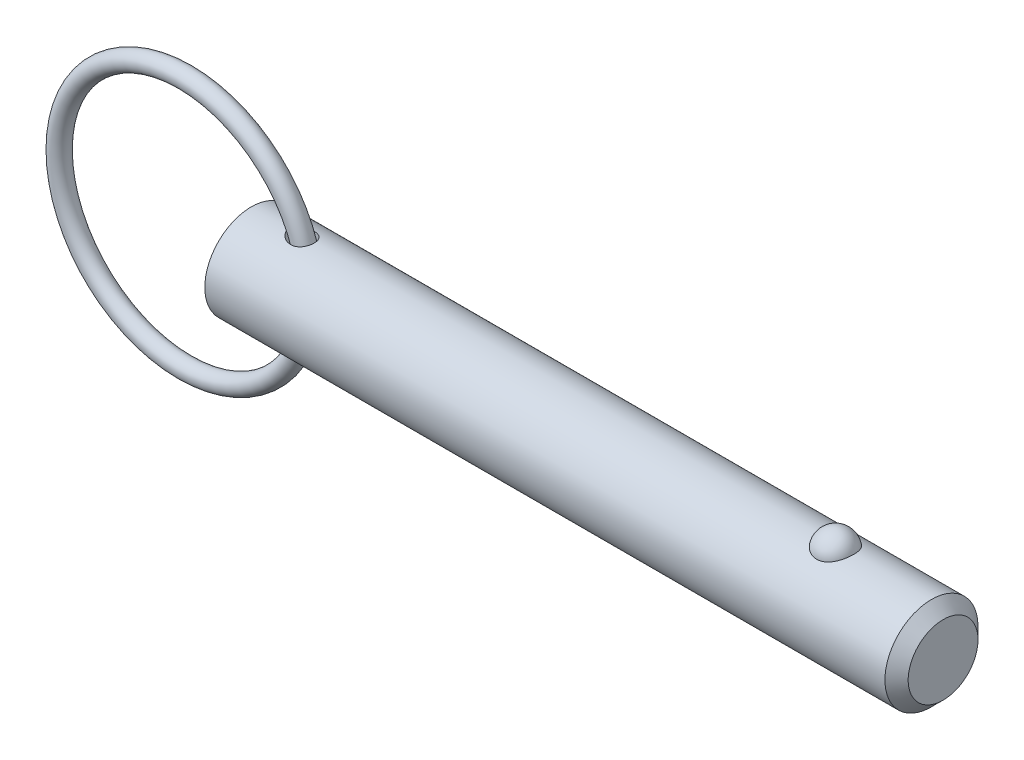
ISO-10303-21;
HEADER;
FILE_DESCRIPTION(('STEP AP214'),'2;1');
FILE_NAME('part.step','',(''),(''),'','','');
FILE_SCHEMA(('AUTOMOTIVE_DESIGN { 1 0 10303 214 1 1 1 1 }'));
ENDSEC;
DATA;
#1=APPLICATION_CONTEXT('core data for automotive mechanical design processes');
#2=APPLICATION_PROTOCOL_DEFINITION('international standard','automotive_design',2000,#1);
#3=PRODUCT_CONTEXT('',#1,'mechanical');
#4=PRODUCT('Part','Part','',(#3));
#5=PRODUCT_RELATED_PRODUCT_CATEGORY('part','',(#4));
#6=PRODUCT_DEFINITION_FORMATION('','',#4);
#7=PRODUCT_DEFINITION_CONTEXT('part definition',#1,'design');
#8=PRODUCT_DEFINITION('design','',#6,#7);
#9=PRODUCT_DEFINITION_SHAPE('','',#8);
#10=(LENGTH_UNIT() NAMED_UNIT(*) SI_UNIT(.MILLI.,.METRE.));
#11=(NAMED_UNIT(*) PLANE_ANGLE_UNIT() SI_UNIT($,.RADIAN.));
#12=(NAMED_UNIT(*) SI_UNIT($,.STERADIAN.) SOLID_ANGLE_UNIT());
#13=UNCERTAINTY_MEASURE_WITH_UNIT(LENGTH_MEASURE(1.E-05),#10,'distance_accuracy_value','');
#14=(GEOMETRIC_REPRESENTATION_CONTEXT(3) GLOBAL_UNCERTAINTY_ASSIGNED_CONTEXT((#13)) GLOBAL_UNIT_ASSIGNED_CONTEXT((#10,
#11,#12)) REPRESENTATION_CONTEXT('',''));
#15=CARTESIAN_POINT('',(0.,0.,0.));
#16=DIRECTION('',(0.,0.,1.));
#17=DIRECTION('',(1.,0.,0.));
#18=AXIS2_PLACEMENT_3D('',#15,#16,#17);
#19=CARTESIAN_POINT('',(-6.70471658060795,0.,0.));
#20=DIRECTION('',(0.,0.,1.));
#21=DIRECTION('',(1.,0.,0.));
#22=AXIS2_PLACEMENT_3D('',#19,#20,#21);
#23=TOROIDAL_SURFACE('',#22,12.7,0.940000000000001);
#24=CARTESIAN_POINT('',(6.93528341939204,0.,0.));
#25=VERTEX_POINT('',#24);
#26=VERTEX_LOOP('',#25);
#27=FACE_BOUND('',#26,.T.);
#28=ADVANCED_FACE('P0_F12',(#27),#23,.T.);
#29=CLOSED_SHELL('',(#28));
#30=MANIFOLD_SOLID_BREP('P0_B1',#29);
#31=CARTESIAN_POINT('',(0.,0.,0.));
#32=DIRECTION('',(1.,0.,0.));
#33=DIRECTION('',(0.,0.,-1.));
#34=AXIS2_PLACEMENT_3D('',#31,#32,#33);
#35=CYLINDRICAL_SURFACE('',#34,4.7);
#36=CARTESIAN_POINT('',(4.16378072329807,4.63584137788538,-0.773934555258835));
#37=CARTESIAN_POINT('',(4.22041228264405,4.62659903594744,-0.829297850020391));
#38=CARTESIAN_POINT('',(4.28206987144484,4.61719767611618,-0.879522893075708));
#39=CARTESIAN_POINT('',(4.4130315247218,4.59925351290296,-0.968997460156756));
#40=CARTESIAN_POINT('',(4.48234424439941,4.59071170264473,-1.00823437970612));
#41=CARTESIAN_POINT('',(4.62650734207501,4.5755493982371,-1.07495006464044));
#42=CARTESIAN_POINT('',(4.70135029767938,4.56892638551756,-1.10244426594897));
#43=CARTESIAN_POINT('',(4.85470490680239,4.55848940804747,-1.14483874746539));
#44=CARTESIAN_POINT('',(4.93321503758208,4.55467428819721,-1.15974420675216));
#45=CARTESIAN_POINT('',(5.09197970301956,4.55051176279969,-1.17597559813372));
#46=CARTESIAN_POINT('',(5.17223836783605,4.55017372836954,-1.17726483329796));
#47=CARTESIAN_POINT('',(5.33159446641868,4.55326696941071,-1.16524823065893));
#48=CARTESIAN_POINT('',(5.41069268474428,4.55669556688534,-1.15195276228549));
#49=CARTESIAN_POINT('',(5.55698758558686,4.56647801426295,-1.11249214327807));
#50=CARTESIAN_POINT('',(5.62458628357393,4.57250771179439,-1.08773548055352));
#51=CARTESIAN_POINT('',(5.75397700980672,4.58665356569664,-1.02644632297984));
#52=CARTESIAN_POINT('',(5.81577171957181,4.59476875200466,-0.989919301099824));
#53=CARTESIAN_POINT('',(5.92681484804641,4.61135052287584,-0.909391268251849));
#54=CARTESIAN_POINT('',(5.9766679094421,4.61973919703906,-0.866204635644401));
#55=CARTESIAN_POINT('',(6.0681785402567,4.63643253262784,-0.771868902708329));
#56=CARTESIAN_POINT('',(6.10983710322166,4.64473720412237,-0.72072076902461));
#57=CARTESIAN_POINT('',(6.18318089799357,4.660174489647,-0.612928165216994));
#58=CARTESIAN_POINT('',(6.21503150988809,4.66732544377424,-0.556398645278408));
#59=CARTESIAN_POINT('',(6.26900210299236,4.67985590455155,-0.438689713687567));
#60=CARTESIAN_POINT('',(6.29112194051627,4.68523538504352,-0.377510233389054));
#61=CARTESIAN_POINT('',(6.32523846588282,4.6936733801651,-0.251831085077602));
#62=CARTESIAN_POINT('',(6.33717189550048,4.69671737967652,-0.187313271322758));
#63=CARTESIAN_POINT('',(6.35042407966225,4.70010386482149,-0.0571258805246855));
#64=CARTESIAN_POINT('',(6.35174249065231,4.70044626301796,0.0085437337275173));
#65=CARTESIAN_POINT('',(6.34371729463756,4.69838816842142,0.139481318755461));
#66=CARTESIAN_POINT('',(6.33432596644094,4.69597539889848,0.204746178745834));
#67=CARTESIAN_POINT('',(6.30500866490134,4.68864655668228,0.332720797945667));
#68=CARTESIAN_POINT('',(6.28508259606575,4.68373046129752,0.395430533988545));
#69=CARTESIAN_POINT('',(6.23516511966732,4.67193431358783,0.516455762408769));
#70=CARTESIAN_POINT('',(6.20518126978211,4.66505573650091,0.574774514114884));
#71=CARTESIAN_POINT('',(6.13586314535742,4.65009270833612,0.685387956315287));
#72=CARTESIAN_POINT('',(6.09652950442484,4.64200833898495,0.737683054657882));
#73=CARTESIAN_POINT('',(6.00979078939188,4.62559001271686,0.834455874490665));
#74=CARTESIAN_POINT('',(5.96243625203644,4.61725787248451,0.878979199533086));
#75=CARTESIAN_POINT('',(5.86079843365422,4.60122574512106,0.959378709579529));
#76=CARTESIAN_POINT('',(5.80651591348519,4.59352568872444,0.9952558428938));
#77=CARTESIAN_POINT('',(5.69277386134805,4.57961669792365,1.05741527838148));
#78=CARTESIAN_POINT('',(5.63333134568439,4.57340309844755,1.08372773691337));
#79=CARTESIAN_POINT('',(5.51084249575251,4.56305640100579,1.12650026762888));
#80=CARTESIAN_POINT('',(5.44779577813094,4.55892352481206,1.14295928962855));
#81=CARTESIAN_POINT('',(5.31795668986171,4.55299444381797,1.1663590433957));
#82=CARTESIAN_POINT('',(5.25110869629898,4.55127026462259,1.17300670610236));
#83=CARTESIAN_POINT('',(5.1171681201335,4.55043953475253,1.17622268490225));
#84=CARTESIAN_POINT('',(5.05007546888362,4.55133378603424,1.17278791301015));
#85=CARTESIAN_POINT('',(4.91166083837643,4.55569951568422,1.15571913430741));
#86=CARTESIAN_POINT('',(4.8404469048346,4.55937764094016,1.1412666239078));
#87=CARTESIAN_POINT('',(4.70108819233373,4.56903562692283,1.10196123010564));
#88=CARTESIAN_POINT('',(4.63294574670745,4.57501720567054,1.07710058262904));
#89=CARTESIAN_POINT('',(4.49477300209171,4.58927184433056,1.01474439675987));
#90=CARTESIAN_POINT('',(4.42520748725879,4.59771156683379,0.976252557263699));
#91=CARTESIAN_POINT('',(4.29354165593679,4.61552030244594,0.888246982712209));
#92=CARTESIAN_POINT('',(4.23143936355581,4.62488906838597,0.83873617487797));
#93=CARTESIAN_POINT('',(4.12609666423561,4.64192969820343,0.738015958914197));
#94=CARTESIAN_POINT('',(4.08142630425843,4.64963595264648,0.688308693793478));
#95=CARTESIAN_POINT('',(4.00081170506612,4.66411457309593,0.582144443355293));
#96=CARTESIAN_POINT('',(3.96485623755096,4.6708881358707,0.525696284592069));
#97=CARTESIAN_POINT('',(3.90818393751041,4.68183565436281,0.415917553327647));
#98=CARTESIAN_POINT('',(3.88599581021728,4.68624644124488,0.363372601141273));
#99=CARTESIAN_POINT('',(3.85055971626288,4.693376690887,0.25523059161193));
#100=CARTESIAN_POINT('',(3.83730635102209,4.69609717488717,0.199635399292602));
#101=CARTESIAN_POINT('',(3.82058225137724,4.69954043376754,0.0867104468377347));
#102=CARTESIAN_POINT('',(3.81714632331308,4.70025610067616,0.0293752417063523));
#103=CARTESIAN_POINT('',(3.82041409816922,4.69957935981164,-0.0849928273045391));
#104=CARTESIAN_POINT('',(3.82711802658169,4.69818690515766,-0.142025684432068));
#105=CARTESIAN_POINT('',(3.84950128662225,4.69360426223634,-0.250744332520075));
#106=CARTESIAN_POINT('',(3.86463891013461,4.69052274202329,-0.302548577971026));
#107=CARTESIAN_POINT('',(3.9026119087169,4.68295207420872,-0.403121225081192));
#108=CARTESIAN_POINT('',(3.92544863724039,4.67846267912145,-0.451889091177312));
#109=CARTESIAN_POINT('',(3.97999306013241,4.6680441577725,-0.549522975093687));
#110=CARTESIAN_POINT('',(4.01228648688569,4.66202553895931,-0.598050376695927));
#111=CARTESIAN_POINT('',(4.08340845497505,4.64931397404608,-0.689954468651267));
#112=CARTESIAN_POINT('',(4.12224260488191,4.64262045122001,-0.733326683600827));
#113=CARTESIAN_POINT('',(4.16378072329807,4.63584137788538,-0.773934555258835));
#114=B_SPLINE_CURVE_WITH_KNOTS('',3,(#36,#37,#38,#39,#40,#41,#42,#43,#44,#45,#46,#47,#48,#49,
#50,#51,#52,#53,#54,#55,#56,#57,#58,#59,#60,#61,#62,#63,#64,#65,#66,#67,#68,#69,#70,#71,#72,#73,
#74,#75,#76,#77,#78,#79,#80,#81,#82,#83,#84,#85,#86,#87,#88,#89,#90,#91,#92,#93,#94,#95,#96,#97,
#98,#99,#100,#101,#102,#103,#104,#105,#106,#107,#108,#109,#110,#111,#112,#113),.UNSPECIFIED.,
.T.,.F.,(4,2,2,2,2,2,2,2,2,2,2,2,2,2,2,2,2,2,2,2,2,2,2,2,2,2,2,2,2,2,2,2,2,2,2,2,2,2,4),(0.,
0.238977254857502,0.478227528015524,0.717162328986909,0.95599878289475,1.19547875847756,
1.43478857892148,1.65034375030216,1.86579883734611,2.06429861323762,2.26277430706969,
2.45769248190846,2.65261353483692,2.848736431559,3.04486567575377,3.24187227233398,
3.43888065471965,3.63574133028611,3.83258866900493,4.0282389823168,4.22386782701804,
4.41887441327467,4.61390177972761,4.81464443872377,5.0154485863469,5.23282834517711,
5.45037055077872,5.68914354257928,5.92785317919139,6.12887730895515,6.32964104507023,
6.50053592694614,6.67132745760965,6.84272375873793,7.0141238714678,7.17560768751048,
7.33711990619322,7.5122540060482,7.68753905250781),.UNSPECIFIED.);
#115=CARTESIAN_POINT('',(4.16378072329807,4.63584137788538,-0.773934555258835));
#116=VERTEX_POINT('',#115);
#117=EDGE_CURVE('P1_E40',#116,#116,#114,.T.);
#118=ORIENTED_EDGE('',*,*,#117,.T.);
#119=EDGE_LOOP('',(#118));
#120=FACE_BOUND('',#119,.T.);
#121=CARTESIAN_POINT('',(68.675,0.,0.));
#122=DIRECTION('',(1.,0.,0.));
#123=DIRECTION('',(0.,0.,-1.));
#124=AXIS2_PLACEMENT_3D('',#121,#122,#123);
#125=CIRCLE('',#124,4.7);
#126=CARTESIAN_POINT('',(68.675,0.,-4.7));
#127=VERTEX_POINT('',#126);
#128=EDGE_CURVE('P1_E25',#127,#127,#125,.T.);
#129=ORIENTED_EDGE('',*,*,#128,.F.);
#130=EDGE_LOOP('',(#129));
#131=FACE_BOUND('',#130,.T.);
#132=CARTESIAN_POINT('',(0.,0.,0.));
#133=DIRECTION('',(1.,0.,0.));
#134=DIRECTION('',(0.,0.,-1.));
#135=AXIS2_PLACEMENT_3D('',#132,#133,#134);
#136=CIRCLE('',#135,4.7);
#137=CARTESIAN_POINT('',(0.,0.,-4.7));
#138=VERTEX_POINT('',#137);
#139=EDGE_CURVE('P1_E9',#138,#138,#136,.T.);
#140=ORIENTED_EDGE('',*,*,#139,.T.);
#141=EDGE_LOOP('',(#140));
#142=FACE_BOUND('',#141,.T.);
#143=CARTESIAN_POINT('',(58.9806283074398,4.30387706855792,1.88855557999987));
#144=CARTESIAN_POINT('',(58.8828134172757,4.30388592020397,1.88854684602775));
#145=CARTESIAN_POINT('',(58.7848511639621,4.30731231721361,1.88078712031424));
#146=CARTESIAN_POINT('',(58.591662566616,4.32065009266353,1.84993192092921));
#147=CARTESIAN_POINT('',(58.4964438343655,4.33057798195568,1.82679740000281));
#148=CARTESIAN_POINT('',(58.3118175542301,4.3557457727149,1.76594245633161));
#149=CARTESIAN_POINT('',(58.2223953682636,4.37097162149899,1.7282605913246));
#150=CARTESIAN_POINT('',(58.0513907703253,4.4050778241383,1.6393730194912));
#151=CARTESIAN_POINT('',(57.969805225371,4.4239567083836,1.58817274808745));
#152=CARTESIAN_POINT('',(57.8139011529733,4.46404088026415,1.47181116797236));
#153=CARTESIAN_POINT('',(57.7398759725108,4.48529915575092,1.40627540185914));
#154=CARTESIAN_POINT('',(57.6035361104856,4.527485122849,1.2638780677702));
#155=CARTESIAN_POINT('',(57.5412249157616,4.54841271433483,1.18701313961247));
#156=CARTESIAN_POINT('',(57.4270723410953,4.58876216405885,1.02025841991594));
#157=CARTESIAN_POINT('',(57.3758113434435,4.60807744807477,0.929944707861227));
#158=CARTESIAN_POINT('',(57.2884245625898,4.6421320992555,0.741468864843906));
#159=CARTESIAN_POINT('',(57.2522995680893,4.65687122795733,0.643306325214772));
#160=CARTESIAN_POINT('',(57.1956718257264,4.68038485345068,0.440967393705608));
#161=CARTESIAN_POINT('',(57.1753048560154,4.68910744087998,0.336746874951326));
#162=CARTESIAN_POINT('',(57.1511323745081,4.69949255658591,0.126059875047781));
#163=CARTESIAN_POINT('',(57.1473260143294,4.70115544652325,0.0195935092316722));
#164=CARTESIAN_POINT('',(57.1563081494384,4.69727256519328,-0.191500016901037));
#165=CARTESIAN_POINT('',(57.1689415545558,4.69179416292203,-0.296135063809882));
#166=CARTESIAN_POINT('',(57.2102760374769,4.67429351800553,-0.501612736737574));
#167=CARTESIAN_POINT('',(57.2389773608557,4.66227117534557,-0.602455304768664));
#168=CARTESIAN_POINT('',(57.3119285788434,4.63286427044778,-0.797707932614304));
#169=CARTESIAN_POINT('',(57.3562044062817,4.61547077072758,-0.892106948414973));
#170=CARTESIAN_POINT('',(57.4594074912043,4.57709900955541,-1.07173134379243));
#171=CARTESIAN_POINT('',(57.5183362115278,4.55612039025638,-1.15695580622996));
#172=CARTESIAN_POINT('',(57.6502161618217,4.51257918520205,-1.31664252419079));
#173=CARTESIAN_POINT('',(57.7232867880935,4.49000423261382,-1.39100294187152));
#174=CARTESIAN_POINT('',(57.8814784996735,4.44594443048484,-1.52598548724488));
#175=CARTESIAN_POINT('',(57.9665990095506,4.42445952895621,-1.58660827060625));
#176=CARTESIAN_POINT('',(58.1452673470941,4.38543655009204,-1.69145998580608));
#177=CARTESIAN_POINT('',(58.2386518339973,4.36783887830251,-1.73594433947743));
#178=CARTESIAN_POINT('',(58.4324220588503,4.3382941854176,-1.80852276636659));
#179=CARTESIAN_POINT('',(58.5328051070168,4.32634500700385,-1.83662309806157));
#180=CARTESIAN_POINT('',(58.7322875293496,4.31005085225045,-1.87453136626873));
#181=CARTESIAN_POINT('',(58.8311967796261,4.30535309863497,-1.88518956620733));
#182=CARTESIAN_POINT('',(59.0295210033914,4.30299844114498,-1.89055986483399));
#183=CARTESIAN_POINT('',(59.1289358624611,4.30534000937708,-1.88527542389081));
#184=CARTESIAN_POINT('',(59.3218638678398,4.31657737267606,-1.85939299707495));
#185=CARTESIAN_POINT('',(59.4154624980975,4.32524571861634,-1.83932621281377));
#186=CARTESIAN_POINT('',(59.5977839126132,4.34791518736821,-1.7850744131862));
#187=CARTESIAN_POINT('',(59.6865063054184,4.36191673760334,-1.75088826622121));
#188=CARTESIAN_POINT('',(59.858694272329,4.39411605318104,-1.66845234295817));
#189=CARTESIAN_POINT('',(59.9420089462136,4.41239631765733,-1.61992036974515));
#190=CARTESIAN_POINT('',(60.099399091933,4.45109244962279,-1.51034589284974));
#191=CARTESIAN_POINT('',(60.1734723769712,4.47150882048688,-1.44930043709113));
#192=CARTESIAN_POINT('',(60.3144058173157,4.51353865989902,-1.31275193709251));
#193=CARTESIAN_POINT('',(60.3807014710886,4.53515983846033,-1.23666813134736));
#194=CARTESIAN_POINT('',(60.5000698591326,4.57635116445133,-1.07425533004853));
#195=CARTESIAN_POINT('',(60.5531402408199,4.59592094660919,-0.987924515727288));
#196=CARTESIAN_POINT('',(60.6464438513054,4.63161819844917,-0.804428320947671));
#197=CARTESIAN_POINT('',(60.6862298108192,4.64762063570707,-0.707010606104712));
#198=CARTESIAN_POINT('',(60.7498257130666,4.67374032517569,-0.50634418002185));
#199=CARTESIAN_POINT('',(60.7736358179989,4.68385763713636,-0.403095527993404));
#200=CARTESIAN_POINT('',(60.8047510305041,4.69716075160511,-0.193975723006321));
#201=CARTESIAN_POINT('',(60.8120987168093,4.70036443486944,-0.0881120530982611));
#202=CARTESIAN_POINT('',(60.8102611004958,4.6995691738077,0.123441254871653));
#203=CARTESIAN_POINT('',(60.8010764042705,4.69557049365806,0.229130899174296));
#204=CARTESIAN_POINT('',(60.7664922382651,4.68082941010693,0.436545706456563));
#205=CARTESIAN_POINT('',(60.741209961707,4.67013575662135,0.538293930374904));
#206=CARTESIAN_POINT('',(60.675050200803,4.64311776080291,0.73579747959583));
#207=CARTESIAN_POINT('',(60.634171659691,4.62679303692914,0.831552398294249));
#208=CARTESIAN_POINT('',(60.5372869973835,4.59002712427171,1.01512750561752));
#209=CARTESIAN_POINT('',(60.4811735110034,4.56955699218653,1.10288523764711));
#210=CARTESIAN_POINT('',(60.3551085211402,4.52671789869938,1.26730106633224));
#211=CARTESIAN_POINT('',(60.2851572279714,4.50434896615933,1.34395933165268));
#212=CARTESIAN_POINT('',(60.1327247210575,4.46008413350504,1.48428028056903));
#213=CARTESIAN_POINT('',(60.0502095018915,4.43818970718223,1.54790656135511));
#214=CARTESIAN_POINT('',(59.8747358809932,4.39746476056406,1.66008504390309));
#215=CARTESIAN_POINT('',(59.7817736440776,4.37863537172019,1.70863168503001));
#216=CARTESIAN_POINT('',(59.5910997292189,4.34688784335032,1.78783023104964));
#217=CARTESIAN_POINT('',(59.4936298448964,4.33380220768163,1.81899757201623));
#218=CARTESIAN_POINT('',(59.2944052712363,4.31435159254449,1.86467392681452));
#219=CARTESIAN_POINT('',(59.1926639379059,4.30796708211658,1.87923136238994));
#220=CARTESIAN_POINT('',(59.0539136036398,4.3043503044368,1.8874737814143));
#221=CARTESIAN_POINT('',(59.0172813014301,4.30387375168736,1.8885588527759));
#222=CARTESIAN_POINT('',(58.9806283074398,4.30387706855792,1.88855557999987));
#223=B_SPLINE_CURVE_WITH_KNOTS('',3,(#143,#144,#145,#146,#147,#148,#149,#150,#151,#152,#153,
#154,#155,#156,#157,#158,#159,#160,#161,#162,#163,#164,#165,#166,#167,#168,#169,#170,#171,#172,
#173,#174,#175,#176,#177,#178,#179,#180,#181,#182,#183,#184,#185,#186,#187,#188,#189,#190,#191,
#192,#193,#194,#195,#196,#197,#198,#199,#200,#201,#202,#203,#204,#205,#206,#207,#208,#209,#210,
#211,#212,#213,#214,#215,#216,#217,#218,#219,#220,#221,#222),.UNSPECIFIED.,.T.,.F.,(4,2,2,2,2,2,
2,2,2,2,2,2,2,2,2,2,2,2,2,2,2,2,2,2,2,2,2,2,2,2,2,2,2,2,2,2,2,2,2,4),(0.,0.293339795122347,
0.587427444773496,0.88074090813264,1.17393661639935,1.47597417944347,1.77810150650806,
2.0935049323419,2.40892479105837,2.72703308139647,3.0451250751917,3.36023788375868,
3.67535550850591,3.9910003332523,4.30667668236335,4.62514463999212,4.94359739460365,
5.25676407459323,5.56981105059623,5.8670864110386,6.16429725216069,6.4513188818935,
6.73836351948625,7.03148013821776,7.3246659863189,7.63288296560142,7.94115473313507,
8.25895074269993,8.57674352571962,8.89371340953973,9.21067166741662,9.52534839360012,
9.84004644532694,10.157022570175,10.4739938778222,10.7918388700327,11.1098009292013,
11.4177488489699,11.7247967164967,11.834716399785),.UNSPECIFIED.);
#224=CARTESIAN_POINT('',(58.9806283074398,4.30387706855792,1.88855557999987));
#225=VERTEX_POINT('',#224);
#226=EDGE_CURVE('P1_E34',#225,#225,#223,.T.);
#227=ORIENTED_EDGE('',*,*,#226,.T.);
#228=EDGE_LOOP('',(#227));
#229=FACE_BOUND('',#228,.T.);
#230=CARTESIAN_POINT('',(4.16378072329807,-4.63584137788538,-0.773934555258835));
#231=CARTESIAN_POINT('',(4.11797605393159,-4.64331682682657,-0.729154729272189));
#232=CARTESIAN_POINT('',(4.07545237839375,-4.65068929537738,-0.681007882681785));
#233=CARTESIAN_POINT('',(3.99850919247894,-4.66454993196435,-0.578483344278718));
#234=CARTESIAN_POINT('',(3.96408464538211,-4.67103864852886,-0.524109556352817));
#235=CARTESIAN_POINT('',(3.90486465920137,-4.68247538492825,-0.409579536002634));
#236=CARTESIAN_POINT('',(3.8801478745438,-4.68741075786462,-0.349380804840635));
#237=CARTESIAN_POINT('',(3.84254060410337,-4.69500854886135,-0.225256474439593));
#238=CARTESIAN_POINT('',(3.82963753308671,-4.69767338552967,-0.161334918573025));
#239=CARTESIAN_POINT('',(3.81750619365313,-4.70018000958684,-0.039677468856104));
#240=CARTESIAN_POINT('',(3.81686237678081,-4.70031401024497,0.0179134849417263));
#241=CARTESIAN_POINT('',(3.8257005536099,-4.69848615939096,0.132270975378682));
#242=CARTESIAN_POINT('',(3.83518142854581,-4.6965245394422,0.189037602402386));
#243=CARTESIAN_POINT('',(3.86276707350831,-4.69091189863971,0.296808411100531));
#244=CARTESIAN_POINT('',(3.88034293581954,-4.68736483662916,0.347956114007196));
#245=CARTESIAN_POINT('',(3.92293217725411,-4.67896699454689,0.446919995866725));
#246=CARTESIAN_POINT('',(3.9479474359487,-4.67411588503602,0.49473532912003));
#247=CARTESIAN_POINT('',(4.00723361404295,-4.66297432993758,0.590975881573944));
#248=CARTESIAN_POINT('',(4.04218787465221,-4.65658759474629,0.638966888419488));
#249=CARTESIAN_POINT('',(4.11850165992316,-4.64327412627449,0.72945262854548));
#250=CARTESIAN_POINT('',(4.15986486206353,-4.63634708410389,0.77194418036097));
#251=CARTESIAN_POINT('',(4.25563139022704,-4.62124878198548,0.858077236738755));
#252=CARTESIAN_POINT('',(4.31104724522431,-4.61307408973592,0.90059363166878));
#253=CARTESIAN_POINT('',(4.42760239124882,-4.59748077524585,0.977085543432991));
#254=CARTESIAN_POINT('',(4.48874590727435,-4.59006271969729,1.01105468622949));
#255=CARTESIAN_POINT('',(4.62409915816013,-4.57577604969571,1.07399161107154));
#256=CARTESIAN_POINT('',(4.69895162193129,-4.56912175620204,1.10163764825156));
#257=CARTESIAN_POINT('',(4.8523861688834,-4.55861611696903,1.14433682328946));
#258=CARTESIAN_POINT('',(4.93096882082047,-4.55476520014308,1.15938803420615));
#259=CARTESIAN_POINT('',(5.0898384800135,-4.55053674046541,1.17587995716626));
#260=CARTESIAN_POINT('',(5.17012835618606,-4.55016559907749,1.17729558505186));
#261=CARTESIAN_POINT('',(5.329560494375,-4.55319561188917,1.16552635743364));
#262=CARTESIAN_POINT('',(5.40870366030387,-4.55659361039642,1.15235371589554));
#263=CARTESIAN_POINT('',(5.55512154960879,-4.56632591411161,1.11311448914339));
#264=CARTESIAN_POINT('',(5.62279525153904,-4.57233592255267,1.08845479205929));
#265=CARTESIAN_POINT('',(5.75235194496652,-4.58645252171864,1.02734156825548));
#266=CARTESIAN_POINT('',(5.81423750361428,-4.59455817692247,0.990893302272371));
#267=CARTESIAN_POINT('',(5.92544729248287,-4.61112960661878,0.91050755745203));
#268=CARTESIAN_POINT('',(5.97537756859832,-4.61951638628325,0.867388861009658));
#269=CARTESIAN_POINT('',(6.067050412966,-4.63621447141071,0.773173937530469));
#270=CARTESIAN_POINT('',(6.10879399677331,-4.64452578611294,0.722078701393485));
#271=CARTESIAN_POINT('',(6.18230323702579,-4.65998194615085,0.614385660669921));
#272=CARTESIAN_POINT('',(6.21423602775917,-4.66714520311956,0.557904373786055));
#273=CARTESIAN_POINT('',(6.26837651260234,-4.67970630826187,0.440277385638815));
#274=CARTESIAN_POINT('',(6.29058407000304,-4.68510413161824,0.37913161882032));
#275=CARTESIAN_POINT('',(6.32487950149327,-4.69358284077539,0.253506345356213));
#276=CARTESIAN_POINT('',(6.33690441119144,-4.69664929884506,0.189008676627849));
#277=CARTESIAN_POINT('',(6.35034148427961,-4.70008248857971,0.0588455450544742));
#278=CARTESIAN_POINT('',(6.35175330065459,-4.70044913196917,-0.00681995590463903));
#279=CARTESIAN_POINT('',(6.34391515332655,-4.69843881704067,-0.137767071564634));
#280=CARTESIAN_POINT('',(6.33461722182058,-4.69604951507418,-0.203045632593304));
#281=CARTESIAN_POINT('',(6.30548404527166,-4.68876413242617,-0.331063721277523));
#282=CARTESIAN_POINT('',(6.28564870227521,-4.68386802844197,-0.393803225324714));
#283=CARTESIAN_POINT('',(6.23590713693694,-4.67210599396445,-0.514904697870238));
#284=CARTESIAN_POINT('',(6.20600824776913,-4.66524149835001,-0.573269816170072));
#285=CARTESIAN_POINT('',(6.13685224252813,-4.65029918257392,-0.683989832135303));
#286=CARTESIAN_POINT('',(6.09759575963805,-4.6422214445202,-0.736345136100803));
#287=CARTESIAN_POINT('',(6.01099960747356,-4.62580793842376,-0.833250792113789));
#288=CARTESIAN_POINT('',(5.96371037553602,-4.61747403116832,-0.877846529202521));
#289=CARTESIAN_POINT('',(5.86219002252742,-4.60143050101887,-0.958399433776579));
#290=CARTESIAN_POINT('',(5.80795966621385,-4.59372080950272,-0.994357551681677));
#291=CARTESIAN_POINT('',(5.69431062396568,-4.57978661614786,-1.05668157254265));
#292=CARTESIAN_POINT('',(5.63490936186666,-4.57355737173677,-1.08307825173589));
#293=CARTESIAN_POINT('',(5.51248756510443,-4.56317492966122,-1.12602176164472));
#294=CARTESIAN_POINT('',(5.44946662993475,-4.55902196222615,-1.1425675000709));
#295=CARTESIAN_POINT('',(5.31967752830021,-4.55305083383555,-1.16613984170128));
#296=CARTESIAN_POINT('',(5.25285368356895,-4.55130415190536,-1.17287534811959));
#297=CARTESIAN_POINT('',(5.11894995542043,-4.55042807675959,-1.17626714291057));
#298=CARTESIAN_POINT('',(5.0518700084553,-4.55129938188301,-1.17292074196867));
#299=CARTESIAN_POINT('',(4.9134872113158,-4.55561850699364,-1.15603764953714));
#300=CARTESIAN_POINT('',(4.84229084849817,-4.55927235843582,-1.14168541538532));
#301=CARTESIAN_POINT('',(4.70293860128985,-4.56888540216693,-1.10258192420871));
#302=CARTESIAN_POINT('',(4.63478566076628,-4.57484677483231,-1.07782082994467));
#303=CARTESIAN_POINT('',(4.49401200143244,-4.58932889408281,-1.01452290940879));
#304=CARTESIAN_POINT('',(4.42204931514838,-4.59808779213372,-0.97456802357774));
#305=CARTESIAN_POINT('',(4.28620227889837,-4.61656806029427,-0.882881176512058));
#306=CARTESIAN_POINT('',(4.22231268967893,-4.62628879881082,-0.831156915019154));
#307=CARTESIAN_POINT('',(4.16378072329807,-4.63584137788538,-0.773934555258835));
#308=B_SPLINE_CURVE_WITH_KNOTS('',3,(#230,#231,#232,#233,#234,#235,#236,#237,#238,#239,#240,
#241,#242,#243,#244,#245,#246,#247,#248,#249,#250,#251,#252,#253,#254,#255,#256,#257,#258,#259,
#260,#261,#262,#263,#264,#265,#266,#267,#268,#269,#270,#271,#272,#273,#274,#275,#276,#277,#278,
#279,#280,#281,#282,#283,#284,#285,#286,#287,#288,#289,#290,#291,#292,#293,#294,#295,#296,#297,
#298,#299,#300,#301,#302,#303,#304,#305,#306,#307),.UNSPECIFIED.,.T.,.F.,(4,2,2,2,2,2,2,2,2,2,2,
2,2,2,2,2,2,2,2,2,2,2,2,2,2,2,2,2,2,2,2,2,2,2,2,2,2,2,4),(0.,0.19326332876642,0.386406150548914,
0.581083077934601,0.775552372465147,0.947410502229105,1.11924964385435,1.28117818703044,
1.44314767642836,1.62161944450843,1.80019400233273,2.01034324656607,2.22064874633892,
2.45975127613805,2.69889038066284,2.93846932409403,3.17784783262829,3.39350806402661,
3.60907218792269,3.80761226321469,4.00612769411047,4.20104508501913,4.39596521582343,
4.59208201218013,4.78820522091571,4.98521027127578,5.18221715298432,5.37908078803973,
5.57593110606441,5.7715882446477,5.96722384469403,6.1622240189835,6.35724581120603,
6.55794420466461,6.75869613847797,6.97596054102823,7.1934307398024,7.44055547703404,
7.68751900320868),.UNSPECIFIED.);
#309=CARTESIAN_POINT('',(4.16378072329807,-4.63584137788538,-0.773934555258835));
#310=VERTEX_POINT('',#309);
#311=EDGE_CURVE('P1_E17',#310,#310,#308,.T.);
#312=ORIENTED_EDGE('',*,*,#311,.T.);
#313=EDGE_LOOP('',(#312));
#314=FACE_BOUND('',#313,.T.);
#315=ADVANCED_FACE('P1_F13',(#120,#131,#142,#229,#314),#35,.T.);
#316=CARTESIAN_POINT('',(0.,0.,0.));
#317=DIRECTION('',(-1.,0.,0.));
#318=DIRECTION('',(0.,0.,1.));
#319=AXIS2_PLACEMENT_3D('',#316,#317,#318);
#320=PLANE('',#319);
#321=ORIENTED_EDGE('',*,*,#139,.F.);
#322=EDGE_LOOP('',(#321));
#323=FACE_BOUND('',#322,.T.);
#324=ADVANCED_FACE('P1_F15',(#323),#320,.T.);
#325=CARTESIAN_POINT('',(69.85,0.,0.));
#326=DIRECTION('',(-1.,0.,0.));
#327=DIRECTION('',(0.,0.,1.));
#328=AXIS2_PLACEMENT_3D('',#325,#326,#327);
#329=CONICAL_SURFACE('',#328,3.52500000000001,0.785398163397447);
#330=ORIENTED_EDGE('',*,*,#128,.T.);
#331=EDGE_LOOP('',(#330));
#332=FACE_BOUND('',#331,.T.);
#333=CARTESIAN_POINT('',(69.85,0.,0.));
#334=DIRECTION('',(1.,0.,0.));
#335=DIRECTION('',(0.,0.,-1.));
#336=AXIS2_PLACEMENT_3D('',#333,#334,#335);
#337=CIRCLE('',#336,3.52500000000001);
#338=CARTESIAN_POINT('',(69.85,0.,-3.52500000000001));
#339=VERTEX_POINT('',#338);
#340=EDGE_CURVE('P1_E30',#339,#339,#337,.T.);
#341=ORIENTED_EDGE('',*,*,#340,.F.);
#342=EDGE_LOOP('',(#341));
#343=FACE_BOUND('',#342,.T.);
#344=ADVANCED_FACE('P1_F55',(#332,#343),#329,.T.);
#345=CARTESIAN_POINT('',(69.85,3.52500000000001,0.));
#346=DIRECTION('',(1.,0.,0.));
#347=DIRECTION('',(0.,0.,-1.));
#348=AXIS2_PLACEMENT_3D('',#345,#346,#347);
#349=PLANE('',#348);
#350=ORIENTED_EDGE('',*,*,#340,.T.);
#351=EDGE_LOOP('',(#350));
#352=FACE_BOUND('',#351,.T.);
#353=ADVANCED_FACE('P1_F51',(#352),#349,.T.);
#354=CARTESIAN_POINT('',(58.9806283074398,4.23,0.));
#355=DIRECTION('',(-1.,0.,0.));
#356=DIRECTION('',(0.,1.,0.));
#357=AXIS2_PLACEMENT_3D('',#354,#355,#356);
#358=SPHERICAL_SURFACE('',#357,1.89);
#359=ORIENTED_EDGE('',*,*,#226,.F.);
#360=EDGE_LOOP('',(#359));
#361=FACE_BOUND('',#360,.T.);
#362=ADVANCED_FACE('P1_F46',(#361),#358,.T.);
#363=CARTESIAN_POINT('',(-6.70471658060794,0.,0.));
#364=DIRECTION('',(0.,0.,1.));
#365=DIRECTION('',(1.,0.,0.));
#366=AXIS2_PLACEMENT_3D('',#363,#364,#365);
#367=TOROIDAL_SURFACE('',#366,12.7,1.175);
#368=ORIENTED_EDGE('',*,*,#311,.F.);
#369=EDGE_LOOP('',(#368));
#370=FACE_BOUND('',#369,.T.);
#371=ORIENTED_EDGE('',*,*,#117,.F.);
#372=EDGE_LOOP('',(#371));
#373=FACE_BOUND('',#372,.T.);
#374=ADVANCED_FACE('P1_F50',(#370,#373),#367,.F.);
#375=CLOSED_SHELL('',(#315,#324,#344,#353,#362,#374));
#376=MANIFOLD_SOLID_BREP('P1_B1',#375);
#377=ADVANCED_BREP_SHAPE_REPRESENTATION('',(#18,#30,#376),#14);
#378=SHAPE_DEFINITION_REPRESENTATION(#9,#377);
ENDSEC;
END-ISO-10303-21;
